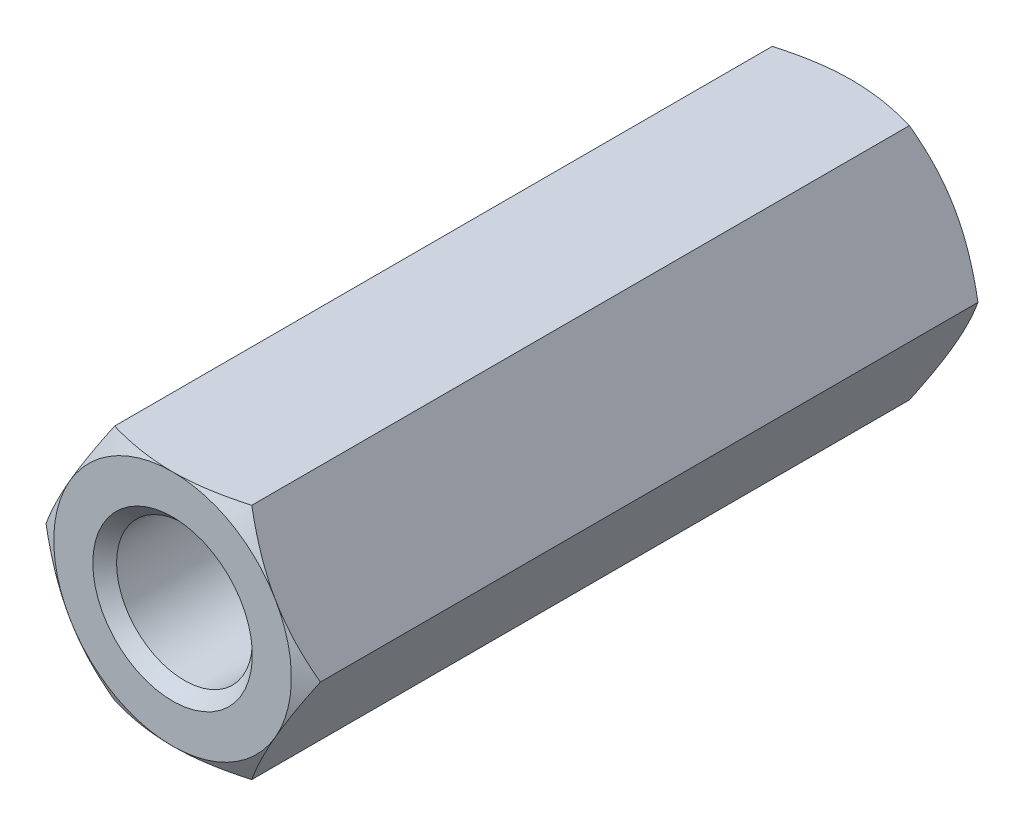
from build123d import *

# Parameters (mm, degrees)
BOSS_EXTRUDE1_DEPTH      = 10
SKETCH2_OUTSIDE_W        = 55.756
SKETCH2_OUTSIDE_H        = 54.674
SKETCH2_OUTSIDE_R        = 3.5
CUT_EXTRUDE1_DEPTH       = 12.339459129
CUT_EXTRUDE1_DRAFT       = -60
SKETCH3_R                = 2
SKETCH3_R_2              = 1.65
CUT_EXTRUDE2_DEPTH       = 10
SKETCH3_2_R              = 1.65
CUT_EXTRUDE3_DEPTH       = 11.05
CHAMFER1_SIZE            = 0.35
MIRROR1_COPY_1_SKETCH_W  = 55.756
MIRROR1_COPY_1_SKETCH_H  = 54.674
MIRROR1_COPY_1_SKETCH_R  = 3.5
MIRROR1_COPY_1_DEPTH     = 12.339459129
MIRROR1_COPY_1_DRAFT     = -60
CHAMFER1_OF_MIRROR1_SIZE = 0.35


with BuildPart() as part:
    # Sketch1 → Boss-Extrude1 (new body)
    with BuildSketch(Plane.XY):
        Polygon((2.020725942, 3.5), (-2.020725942, 3.5), (-4.041451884, 0), (-2.020725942, -3.5), (2.020725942, -3.5), (4.041451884, 0), align=None)
    boss_extrude1 = extrude(amount=-BOSS_EXTRUDE1_DEPTH)


with BuildPart() as cut_extrude1_tool:
    # Sketch2 outside → Cut-Extrude1 (with draft: the straight prism first)
    with BuildSketch(Plane(origin=(0, 0, -10), x_dir=(-1, 0, 0), z_dir=(0, 0, -1))):
        Rectangle(SKETCH2_OUTSIDE_W, SKETCH2_OUTSIDE_H)
        Circle(SKETCH2_OUTSIDE_R, mode=Mode.SUBTRACT)
    extrude(amount=-CUT_EXTRUDE1_DEPTH)
    # Cut-Extrude1: the draft: its side faces are tilted about the plane it starts from
    cut_extrude1_sides = [cut_extrude1_tool.faces().sort_by_distance(p)[0] for p in [
        (0, -27.337, -3.830270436),
        (-27.878, 0, -3.830270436),
        (0, 27.337, -3.830270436),
        (27.878, 0, -3.830270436),
        (3.5, 0, -3.830270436),
    ]]
    draft(cut_extrude1_sides, Plane(origin=(0, 0, -10), x_dir=(-1, 0, 0), z_dir=(0, 0, -1)), CUT_EXTRUDE1_DRAFT)


with BuildPart() as part_1:
    add(part.part)

    # Cut-Extrude1: cut by cut_extrude1_tool
    add(cut_extrude1_tool.part, mode=Mode.SUBTRACT)

    # Sketch3 → Cut-Extrude2 (cut)
    with BuildSketch(Plane(origin=(0, 0, -10), x_dir=(-1, 0, 0), z_dir=(0, 0, -1))):
        Circle(SKETCH3_R)
        Circle(SKETCH3_R_2, mode=Mode.SUBTRACT)
    cut_extrude2 = extrude(amount=-CUT_EXTRUDE2_DEPTH, mode=Mode.SUBTRACT)


with BuildPart() as cut_extrude2_piece_1:
    # of the separate pieces the step leaves, piece 1, a body of its own (cut_extrude2_pieces)
    add(part_1.part.solids().sort_by_distance((2.020725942, 3.5, 0))[0])

    # Chamfer1
    chamfer1_edges = [cut_extrude2_piece_1.edges().sort_by_distance(p)[0] for p in [
        (2, 0, -10),
    ]]
    chamfer(chamfer1_edges, length=CHAMFER1_SIZE)


with BuildPart() as cut_extrude2_piece_2:
    # of the separate pieces the step leaves, piece 2, a body of its own (cut_extrude2_pieces)
    add(part_1.part.solids().sort_by_distance((-1.65, 0, 0))[0])

    # Sketch3_2 → Cut-Extrude3 (cut)
    with BuildSketch(Plane(origin=(0, 0, -10), x_dir=(-1, 0, 0), z_dir=(0, 0, -1))):
        Circle(SKETCH3_2_R)
    cut_extrude3 = extrude(amount=-CUT_EXTRUDE3_DEPTH, mode=Mode.SUBTRACT)


with BuildPart() as cut_extrude2_piece_1_1:
    add(cut_extrude2_piece_1.part)

    # Mirror1: Boss-Extrude1, Cut-Extrude2, Cut-Extrude3 across plane
    add(boss_extrude1.mirror(Plane.XY))
    add(cut_extrude2.mirror(Plane.XY), mode=Mode.SUBTRACT)
    add(cut_extrude3.mirror(Plane.XY), mode=Mode.SUBTRACT)


with BuildPart() as mirror1_copy_1_tool:
    # Mirror1 copy 1 sketch → Mirror1 copy 1 (with draft: the straight prism first)
    with BuildSketch(Plane(origin=(0, 0, 10), x_dir=(-1, 0, 0), z_dir=(0, 0, 1))):
        Rectangle(MIRROR1_COPY_1_SKETCH_W, MIRROR1_COPY_1_SKETCH_H)
        Circle(MIRROR1_COPY_1_SKETCH_R, mode=Mode.SUBTRACT)
    extrude(amount=-MIRROR1_COPY_1_DEPTH)
    # Mirror1 copy 1: the draft: its side faces are tilted about the plane it starts from
    mirror1_copy_1_sides = [mirror1_copy_1_tool.faces().sort_by_distance(p)[0] for p in [
        (0, -27.337, 3.830270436),
        (-27.878, 0, 3.830270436),
        (0, 27.337, 3.830270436),
        (27.878, 0, 3.830270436),
        (3.5, 0, 3.830270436),
    ]]
    draft(mirror1_copy_1_sides, Plane(origin=(0, 0, 10), x_dir=(-1, 0, 0), z_dir=(0, 0, 1)), MIRROR1_COPY_1_DRAFT)


with BuildPart() as cut_extrude2_piece_1_2:
    add(cut_extrude2_piece_1_1.part)

    # Mirror1 copy 1: cut by mirror1_copy_1_tool
    add(mirror1_copy_1_tool.part, mode=Mode.SUBTRACT)

    # Chamfer1 of Mirror1
    chamfer1_of_mirror1_edges = [cut_extrude2_piece_1_2.edges().sort_by_distance(p)[0] for p in [
        (2, 0, 10),
    ]]
    chamfer(chamfer1_of_mirror1_edges, length=CHAMFER1_OF_MIRROR1_SIZE)


solid = cut_extrude2_piece_1_2.part
